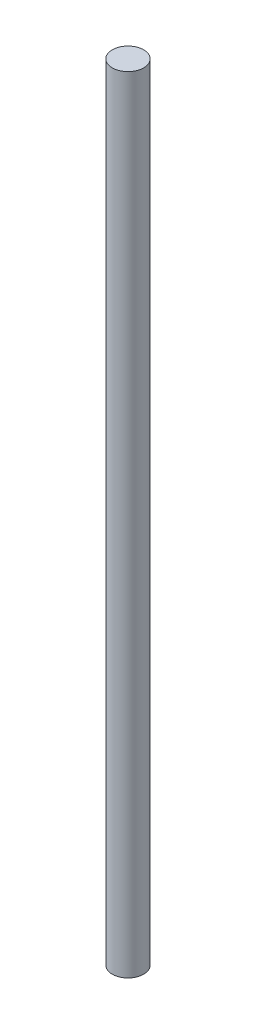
ISO-10303-21;
HEADER;
FILE_DESCRIPTION(('STEP AP214'),'2;1');
FILE_NAME('part.step','',(''),(''),'','','');
FILE_SCHEMA(('AUTOMOTIVE_DESIGN { 1 0 10303 214 1 1 1 1 }'));
ENDSEC;
DATA;
#1=APPLICATION_CONTEXT('core data for automotive mechanical design processes');
#2=APPLICATION_PROTOCOL_DEFINITION('international standard','automotive_design',2000,#1);
#3=PRODUCT_CONTEXT('',#1,'mechanical');
#4=PRODUCT('Part','Part','',(#3));
#5=PRODUCT_RELATED_PRODUCT_CATEGORY('part','',(#4));
#6=PRODUCT_DEFINITION_FORMATION('','',#4);
#7=PRODUCT_DEFINITION_CONTEXT('part definition',#1,'design');
#8=PRODUCT_DEFINITION('design','',#6,#7);
#9=PRODUCT_DEFINITION_SHAPE('','',#8);
#10=(LENGTH_UNIT() NAMED_UNIT(*) SI_UNIT(.MILLI.,.METRE.));
#11=(NAMED_UNIT(*) PLANE_ANGLE_UNIT() SI_UNIT($,.RADIAN.));
#12=(NAMED_UNIT(*) SI_UNIT($,.STERADIAN.) SOLID_ANGLE_UNIT());
#13=UNCERTAINTY_MEASURE_WITH_UNIT(LENGTH_MEASURE(1.E-05),#10,'distance_accuracy_value','');
#14=(GEOMETRIC_REPRESENTATION_CONTEXT(3) GLOBAL_UNCERTAINTY_ASSIGNED_CONTEXT((#13)) GLOBAL_UNIT_ASSIGNED_CONTEXT((#10,
#11,#12)) REPRESENTATION_CONTEXT('',''));
#15=CARTESIAN_POINT('',(0.,0.,0.));
#16=DIRECTION('',(0.,0.,1.));
#17=DIRECTION('',(1.,0.,0.));
#18=AXIS2_PLACEMENT_3D('',#15,#16,#17);
#19=CARTESIAN_POINT('',(0.,200.,0.));
#20=DIRECTION('',(0.,-1.,0.));
#21=DIRECTION('',(0.,0.,-1.));
#22=AXIS2_PLACEMENT_3D('',#19,#20,#21);
#23=CYLINDRICAL_SURFACE('',#22,4.);
#24=CARTESIAN_POINT('',(0.,200.,0.));
#25=DIRECTION('',(0.,1.,0.));
#26=DIRECTION('',(0.,0.,1.));
#27=AXIS2_PLACEMENT_3D('',#24,#25,#26);
#28=CIRCLE('',#27,4.);
#29=CARTESIAN_POINT('',(0.,200.,4.));
#30=VERTEX_POINT('',#29);
#31=EDGE_CURVE('E10',#30,#30,#28,.T.);
#32=ORIENTED_EDGE('',*,*,#31,.F.);
#33=EDGE_LOOP('',(#32));
#34=FACE_BOUND('',#33,.T.);
#35=CARTESIAN_POINT('',(0.,0.,0.));
#36=DIRECTION('',(0.,1.,0.));
#37=DIRECTION('',(0.,0.,1.));
#38=AXIS2_PLACEMENT_3D('',#35,#36,#37);
#39=CIRCLE('',#38,4.);
#40=CARTESIAN_POINT('',(0.,0.,4.));
#41=VERTEX_POINT('',#40);
#42=EDGE_CURVE('E36',#41,#41,#39,.T.);
#43=ORIENTED_EDGE('',*,*,#42,.T.);
#44=EDGE_LOOP('',(#43));
#45=FACE_BOUND('',#44,.T.);
#46=ADVANCED_FACE('F33',(#34,#45),#23,.T.);
#47=CARTESIAN_POINT('',(0.,200.,0.));
#48=DIRECTION('',(0.,1.,0.));
#49=DIRECTION('',(0.,0.,1.));
#50=AXIS2_PLACEMENT_3D('',#47,#48,#49);
#51=PLANE('',#50);
#52=ORIENTED_EDGE('',*,*,#31,.T.);
#53=EDGE_LOOP('',(#52));
#54=FACE_BOUND('',#53,.T.);
#55=ADVANCED_FACE('F48',(#54),#51,.T.);
#56=CARTESIAN_POINT('',(0.,0.,0.));
#57=DIRECTION('',(0.,1.,0.));
#58=DIRECTION('',(0.,0.,1.));
#59=AXIS2_PLACEMENT_3D('',#56,#57,#58);
#60=PLANE('',#59);
#61=ORIENTED_EDGE('',*,*,#42,.F.);
#62=EDGE_LOOP('',(#61));
#63=FACE_BOUND('',#62,.T.);
#64=ADVANCED_FACE('F46',(#63),#60,.F.);
#65=CLOSED_SHELL('',(#46,#55,#64));
#66=MANIFOLD_SOLID_BREP('B2',#65);
#67=ADVANCED_BREP_SHAPE_REPRESENTATION('',(#18,#66),#14);
#68=SHAPE_DEFINITION_REPRESENTATION(#9,#67);
ENDSEC;
END-ISO-10303-21;
